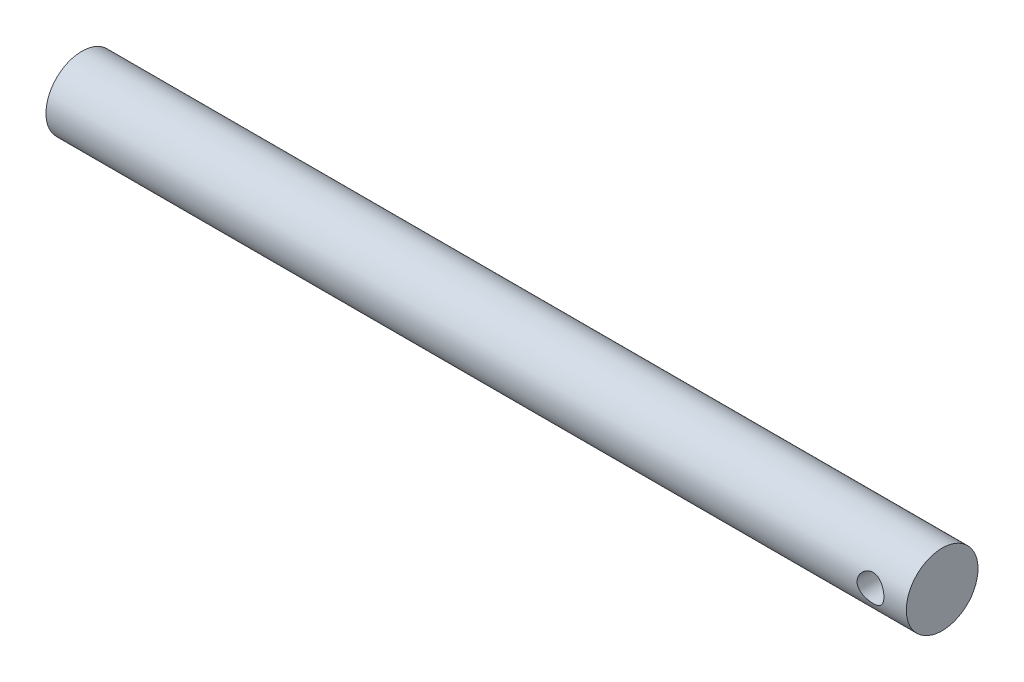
ISO-10303-21;
HEADER;
FILE_DESCRIPTION(('STEP AP214'),'2;1');
FILE_NAME('part.step','',(''),(''),'','','');
FILE_SCHEMA(('AUTOMOTIVE_DESIGN { 1 0 10303 214 1 1 1 1 }'));
ENDSEC;
DATA;
#1=APPLICATION_CONTEXT('core data for automotive mechanical design processes');
#2=APPLICATION_PROTOCOL_DEFINITION('international standard','automotive_design',2000,#1);
#3=PRODUCT_CONTEXT('',#1,'mechanical');
#4=PRODUCT('Part','Part','',(#3));
#5=PRODUCT_RELATED_PRODUCT_CATEGORY('part','',(#4));
#6=PRODUCT_DEFINITION_FORMATION('','',#4);
#7=PRODUCT_DEFINITION_CONTEXT('part definition',#1,'design');
#8=PRODUCT_DEFINITION('design','',#6,#7);
#9=PRODUCT_DEFINITION_SHAPE('','',#8);
#10=(LENGTH_UNIT() NAMED_UNIT(*) SI_UNIT(.MILLI.,.METRE.));
#11=(NAMED_UNIT(*) PLANE_ANGLE_UNIT() SI_UNIT($,.RADIAN.));
#12=(NAMED_UNIT(*) SI_UNIT($,.STERADIAN.) SOLID_ANGLE_UNIT());
#13=UNCERTAINTY_MEASURE_WITH_UNIT(LENGTH_MEASURE(1.E-05),#10,'distance_accuracy_value','');
#14=(GEOMETRIC_REPRESENTATION_CONTEXT(3) GLOBAL_UNCERTAINTY_ASSIGNED_CONTEXT((#13)) GLOBAL_UNIT_ASSIGNED_CONTEXT((#10,
#11,#12)) REPRESENTATION_CONTEXT('',''));
#15=CARTESIAN_POINT('',(0.,0.,0.));
#16=DIRECTION('',(0.,0.,1.));
#17=DIRECTION('',(1.,0.,0.));
#18=AXIS2_PLACEMENT_3D('',#15,#16,#17);
#19=CARTESIAN_POINT('',(152.4,0.,0.));
#20=DIRECTION('',(-1.,0.,0.));
#21=DIRECTION('',(0.,0.,1.));
#22=AXIS2_PLACEMENT_3D('',#19,#20,#21);
#23=CYLINDRICAL_SURFACE('',#22,6.35);
#24=CARTESIAN_POINT('',(148.43125,0.,-6.35));
#25=CARTESIAN_POINT('',(148.431254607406,0.128960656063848,-6.3500034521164));
#26=CARTESIAN_POINT('',(148.420741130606,0.257889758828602,-6.34603727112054));
#27=CARTESIAN_POINT('',(148.379135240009,0.51189485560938,-6.33061179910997));
#28=CARTESIAN_POINT('',(148.348045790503,0.636971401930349,-6.31915358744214));
#29=CARTESIAN_POINT('',(148.266542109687,0.879571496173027,-6.28997396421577));
#30=CARTESIAN_POINT('',(148.216165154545,0.997109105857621,-6.27226463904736));
#31=CARTESIAN_POINT('',(148.097706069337,1.22205640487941,-6.23234668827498));
#32=CARTESIAN_POINT('',(148.029619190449,1.32946336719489,-6.21013685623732));
#33=CARTESIAN_POINT('',(147.874652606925,1.53566243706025,-6.16245667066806));
#34=CARTESIAN_POINT('',(147.787153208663,1.63396728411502,-6.13689404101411));
#35=CARTESIAN_POINT('',(147.597160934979,1.81490019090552,-6.08584350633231));
#36=CARTESIAN_POINT('',(147.494663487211,1.89752345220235,-6.06035562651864));
#37=CARTESIAN_POINT('',(147.272823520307,2.04784646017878,-6.01126672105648));
#38=CARTESIAN_POINT('',(147.152988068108,2.11485786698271,-5.98777455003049));
#39=CARTESIAN_POINT('',(146.902728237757,2.22755851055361,-5.94677278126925));
#40=CARTESIAN_POINT('',(146.772308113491,2.27325626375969,-5.9292607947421));
#41=CARTESIAN_POINT('',(146.51018967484,2.34010884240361,-5.90318880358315));
#42=CARTESIAN_POINT('',(146.378763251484,2.36219354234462,-5.89429104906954));
#43=CARTESIAN_POINT('',(146.113791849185,2.38410045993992,-5.88546672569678));
#44=CARTESIAN_POINT('',(145.980247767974,2.38393187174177,-5.88553645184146));
#45=CARTESIAN_POINT('',(145.723340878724,2.36204807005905,-5.89434799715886));
#46=CARTESIAN_POINT('',(145.599847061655,2.34162296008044,-5.90257056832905));
#47=CARTESIAN_POINT('',(145.358187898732,2.28193866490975,-5.92589839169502));
#48=CARTESIAN_POINT('',(145.240023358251,2.24267664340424,-5.94100468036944));
#49=CARTESIAN_POINT('',(145.009747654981,2.14572450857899,-5.97671052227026));
#50=CARTESIAN_POINT('',(144.897793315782,2.08769979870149,-5.99740859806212));
#51=CARTESIAN_POINT('',(144.684836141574,1.95510267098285,-6.04193308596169));
#52=CARTESIAN_POINT('',(144.583837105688,1.88052453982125,-6.06576057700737));
#53=CARTESIAN_POINT('',(144.388516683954,1.71103576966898,-6.11581261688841));
#54=CARTESIAN_POINT('',(144.295100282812,1.61509549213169,-6.14209064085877));
#55=CARTESIAN_POINT('',(144.125413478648,1.40860873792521,-6.19270618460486));
#56=CARTESIAN_POINT('',(144.049145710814,1.29806002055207,-6.21704340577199));
#57=CARTESIAN_POINT('',(143.914922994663,1.06318595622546,-6.26151901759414));
#58=CARTESIAN_POINT('',(143.857269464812,0.938674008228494,-6.2815866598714));
#59=CARTESIAN_POINT('',(143.764027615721,0.680778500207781,-6.31473715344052));
#60=CARTESIAN_POINT('',(143.728429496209,0.547398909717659,-6.3278231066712));
#61=CARTESIAN_POINT('',(143.682048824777,0.283170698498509,-6.34499053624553));
#62=CARTESIAN_POINT('',(143.670047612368,0.152564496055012,-6.34951373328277));
#63=CARTESIAN_POINT('',(143.667652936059,-0.108858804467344,-6.3504110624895));
#64=CARTESIAN_POINT('',(143.677254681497,-0.239675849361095,-6.34678700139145));
#65=CARTESIAN_POINT('',(143.716867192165,-0.492541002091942,-6.33208839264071));
#66=CARTESIAN_POINT('',(143.746079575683,-0.614732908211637,-6.32130547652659));
#67=CARTESIAN_POINT('',(143.823032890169,-0.852395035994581,-6.29366719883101));
#68=CARTESIAN_POINT('',(143.870776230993,-0.967864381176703,-6.27681104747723));
#69=CARTESIAN_POINT('',(143.984958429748,-1.19260582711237,-6.23807528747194));
#70=CARTESIAN_POINT('',(144.051905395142,-1.301596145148,-6.2160626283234));
#71=CARTESIAN_POINT('',(144.202019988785,-1.50716092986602,-6.16944841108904));
#72=CARTESIAN_POINT('',(144.285193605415,-1.60373079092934,-6.14484589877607));
#73=CARTESIAN_POINT('',(144.471079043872,-1.78757389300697,-6.09398910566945));
#74=CARTESIAN_POINT('',(144.574644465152,-1.87398269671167,-6.06772180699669));
#75=CARTESIAN_POINT('',(144.795321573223,-2.02836541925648,-6.01787619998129));
#76=CARTESIAN_POINT('',(144.912434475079,-2.09633768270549,-5.99429813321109));
#77=CARTESIAN_POINT('',(145.157850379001,-2.21198715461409,-5.9525984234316));
#78=CARTESIAN_POINT('',(145.286197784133,-2.25957900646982,-5.93449982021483));
#79=CARTESIAN_POINT('',(145.549952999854,-2.33216265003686,-5.90635777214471));
#80=CARTESIAN_POINT('',(145.685356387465,-2.35716842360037,-5.89630934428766));
#81=CARTESIAN_POINT('',(145.950013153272,-2.3826207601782,-5.8860673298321));
#82=CARTESIAN_POINT('',(146.079103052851,-2.38454138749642,-5.88528230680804));
#83=CARTESIAN_POINT('',(146.335663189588,-2.36754536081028,-5.89213980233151));
#84=CARTESIAN_POINT('',(146.463133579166,-2.34863068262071,-5.89978152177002));
#85=CARTESIAN_POINT('',(146.708887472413,-2.29164857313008,-5.92213924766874));
#86=CARTESIAN_POINT('',(146.827332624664,-2.25418329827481,-5.93663223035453));
#87=CARTESIAN_POINT('',(147.056324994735,-2.16169393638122,-5.97092957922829));
#88=CARTESIAN_POINT('',(147.166870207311,-2.10666541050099,-5.99073528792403));
#89=CARTESIAN_POINT('',(147.383225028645,-1.97726420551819,-6.03471811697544));
#90=CARTESIAN_POINT('',(147.48848263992,-1.90202872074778,-6.0590699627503));
#91=CARTESIAN_POINT('',(147.685349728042,-1.73568496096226,-6.10879916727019));
#92=CARTESIAN_POINT('',(147.776954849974,-1.64457164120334,-6.13417684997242));
#93=CARTESIAN_POINT('',(147.948970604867,-1.44316512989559,-6.18474799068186));
#94=CARTESIAN_POINT('',(148.028507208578,-1.33210084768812,-6.20985716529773));
#95=CARTESIAN_POINT('',(148.167760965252,-1.09730099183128,-6.25561541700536));
#96=CARTESIAN_POINT('',(148.227476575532,-0.973564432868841,-6.27626414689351));
#97=CARTESIAN_POINT('',(148.327073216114,-0.71119854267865,-6.31149189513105));
#98=CARTESIAN_POINT('',(148.365983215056,-0.572156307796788,-6.3257693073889));
#99=CARTESIAN_POINT('',(148.418062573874,-0.288727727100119,-6.34501909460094));
#100=CARTESIAN_POINT('',(148.431244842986,-0.144344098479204,-6.34999613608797));
#101=CARTESIAN_POINT('',(148.43125,0.,-6.35));
#102=B_SPLINE_CURVE_WITH_KNOTS('',3,(#24,#25,#26,#27,#28,#29,#30,#31,#32,#33,#34,#35,#36,#37,
#38,#39,#40,#41,#42,#43,#44,#45,#46,#47,#48,#49,#50,#51,#52,#53,#54,#55,#56,#57,#58,#59,#60,#61,
#62,#63,#64,#65,#66,#67,#68,#69,#70,#71,#72,#73,#74,#75,#76,#77,#78,#79,#80,#81,#82,#83,#84,#85,
#86,#87,#88,#89,#90,#91,#92,#93,#94,#95,#96,#97,#98,#99,#100,#101),.UNSPECIFIED.,.T.,.F.,(4,2,2,
2,2,2,2,2,2,2,2,2,2,2,2,2,2,2,2,2,2,2,2,2,2,2,2,2,2,2,2,2,2,2,2,2,2,2,4),(0.,0.386349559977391,
0.772643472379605,1.15819454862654,1.54384911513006,1.94426869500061,2.34481060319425,
2.76060970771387,3.17624252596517,3.57482575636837,3.97324430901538,4.34781872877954,
4.72244956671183,5.10416823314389,5.48601885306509,5.89353268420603,6.30110909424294,
6.71498808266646,7.1286830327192,7.52038468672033,7.91199948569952,8.28856670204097,
8.66518290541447,9.05286514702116,9.44069073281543,9.85101724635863,10.2613805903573,
10.6734461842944,11.0852565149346,11.470620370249,11.8559476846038,12.2295148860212,
12.6031765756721,12.9964254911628,13.3897995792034,13.8044607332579,14.219154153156,
14.6518076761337,15.0842440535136),.UNSPECIFIED.);
#103=CARTESIAN_POINT('',(148.43125,0.,-6.35));
#104=VERTEX_POINT('',#103);
#105=EDGE_CURVE('E10',#104,#104,#102,.T.);
#106=ORIENTED_EDGE('',*,*,#105,.T.);
#107=EDGE_LOOP('',(#106));
#108=FACE_BOUND('',#107,.T.);
#109=CARTESIAN_POINT('',(148.43125,0.,6.35));
#110=CARTESIAN_POINT('',(148.431254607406,-0.128960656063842,6.3500034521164));
#111=CARTESIAN_POINT('',(148.420741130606,-0.257889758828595,6.34603727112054));
#112=CARTESIAN_POINT('',(148.379135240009,-0.511894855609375,6.33061179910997));
#113=CARTESIAN_POINT('',(148.348045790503,-0.636971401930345,6.31915358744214));
#114=CARTESIAN_POINT('',(148.266542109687,-0.879571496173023,6.28997396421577));
#115=CARTESIAN_POINT('',(148.216165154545,-0.997109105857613,6.27226463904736));
#116=CARTESIAN_POINT('',(148.097706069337,-1.2220564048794,6.23234668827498));
#117=CARTESIAN_POINT('',(148.029619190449,-1.32946336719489,6.21013685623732));
#118=CARTESIAN_POINT('',(147.874652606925,-1.53566243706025,6.16245667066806));
#119=CARTESIAN_POINT('',(147.787153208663,-1.63396728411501,6.13689404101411));
#120=CARTESIAN_POINT('',(147.597160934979,-1.81490019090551,6.08584350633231));
#121=CARTESIAN_POINT('',(147.494663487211,-1.89752345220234,6.06035562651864));
#122=CARTESIAN_POINT('',(147.272823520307,-2.04784646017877,6.01126672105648));
#123=CARTESIAN_POINT('',(147.152988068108,-2.1148578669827,5.98777455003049));
#124=CARTESIAN_POINT('',(146.902728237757,-2.2275585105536,5.94677278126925));
#125=CARTESIAN_POINT('',(146.772308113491,-2.27325626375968,5.92926079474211));
#126=CARTESIAN_POINT('',(146.51018967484,-2.3401088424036,5.90318880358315));
#127=CARTESIAN_POINT('',(146.378763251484,-2.36219354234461,5.89429104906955));
#128=CARTESIAN_POINT('',(146.113791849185,-2.38410045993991,5.88546672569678));
#129=CARTESIAN_POINT('',(145.980247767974,-2.38393187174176,5.88553645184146));
#130=CARTESIAN_POINT('',(145.723340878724,-2.36204807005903,5.89434799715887));
#131=CARTESIAN_POINT('',(145.599847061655,-2.34162296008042,5.90257056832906));
#132=CARTESIAN_POINT('',(145.358187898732,-2.28193866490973,5.92589839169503));
#133=CARTESIAN_POINT('',(145.24002335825,-2.24267664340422,5.94100468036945));
#134=CARTESIAN_POINT('',(145.009747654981,-2.14572450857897,5.97671052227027));
#135=CARTESIAN_POINT('',(144.897793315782,-2.08769979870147,5.99740859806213));
#136=CARTESIAN_POINT('',(144.684836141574,-1.95510267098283,6.04193308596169));
#137=CARTESIAN_POINT('',(144.583837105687,-1.88052453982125,6.06576057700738));
#138=CARTESIAN_POINT('',(144.388516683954,-1.71103576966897,6.11581261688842));
#139=CARTESIAN_POINT('',(144.295100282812,-1.61509549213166,6.14209064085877));
#140=CARTESIAN_POINT('',(144.125413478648,-1.40860873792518,6.19270618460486));
#141=CARTESIAN_POINT('',(144.049145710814,-1.29806002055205,6.21704340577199));
#142=CARTESIAN_POINT('',(143.914922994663,-1.06318595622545,6.26151901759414));
#143=CARTESIAN_POINT('',(143.857269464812,-0.938674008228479,6.2815866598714));
#144=CARTESIAN_POINT('',(143.764027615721,-0.680778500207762,6.31473715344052));
#145=CARTESIAN_POINT('',(143.728429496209,-0.54739890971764,6.32782310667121));
#146=CARTESIAN_POINT('',(143.682048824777,-0.28317069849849,6.34499053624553));
#147=CARTESIAN_POINT('',(143.670047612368,-0.152564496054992,6.34951373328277));
#148=CARTESIAN_POINT('',(143.667652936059,0.108858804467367,6.35041106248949));
#149=CARTESIAN_POINT('',(143.677254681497,0.23967584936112,6.34678700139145));
#150=CARTESIAN_POINT('',(143.716867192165,0.492541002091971,6.33208839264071));
#151=CARTESIAN_POINT('',(143.746079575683,0.614732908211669,6.32130547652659));
#152=CARTESIAN_POINT('',(143.823032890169,0.852395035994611,6.29366719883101));
#153=CARTESIAN_POINT('',(143.870776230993,0.96786438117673,6.27681104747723));
#154=CARTESIAN_POINT('',(143.984958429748,1.19260582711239,6.23807528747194));
#155=CARTESIAN_POINT('',(144.051905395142,1.30159614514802,6.2160626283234));
#156=CARTESIAN_POINT('',(144.202019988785,1.50716092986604,6.16944841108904));
#157=CARTESIAN_POINT('',(144.285193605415,1.60373079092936,6.14484589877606));
#158=CARTESIAN_POINT('',(144.471079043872,1.78757389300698,6.09398910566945));
#159=CARTESIAN_POINT('',(144.574644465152,1.87398269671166,6.0677218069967));
#160=CARTESIAN_POINT('',(144.795321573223,2.02836541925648,6.0178761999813));
#161=CARTESIAN_POINT('',(144.912434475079,2.09633768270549,5.99429813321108));
#162=CARTESIAN_POINT('',(145.157850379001,2.21198715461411,5.9525984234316));
#163=CARTESIAN_POINT('',(145.286197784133,2.25957900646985,5.93449982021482));
#164=CARTESIAN_POINT('',(145.549952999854,2.33216265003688,5.9063577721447));
#165=CARTESIAN_POINT('',(145.685356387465,2.35716842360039,5.89630934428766));
#166=CARTESIAN_POINT('',(145.950013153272,2.38262076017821,5.8860673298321));
#167=CARTESIAN_POINT('',(146.079103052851,2.38454138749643,5.88528230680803));
#168=CARTESIAN_POINT('',(146.335663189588,2.36754536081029,5.89213980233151));
#169=CARTESIAN_POINT('',(146.463133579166,2.34863068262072,5.89978152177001));
#170=CARTESIAN_POINT('',(146.708887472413,2.29164857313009,5.92213924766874));
#171=CARTESIAN_POINT('',(146.827332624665,2.25418329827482,5.93663223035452));
#172=CARTESIAN_POINT('',(147.056324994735,2.16169393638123,5.97092957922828));
#173=CARTESIAN_POINT('',(147.166870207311,2.106665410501,5.99073528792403));
#174=CARTESIAN_POINT('',(147.383225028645,1.9772642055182,6.03471811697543));
#175=CARTESIAN_POINT('',(147.48848263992,1.90202872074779,6.0590699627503));
#176=CARTESIAN_POINT('',(147.685349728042,1.73568496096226,6.10879916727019));
#177=CARTESIAN_POINT('',(147.776954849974,1.64457164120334,6.13417684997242));
#178=CARTESIAN_POINT('',(147.948970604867,1.44316512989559,6.18474799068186));
#179=CARTESIAN_POINT('',(148.028507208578,1.33210084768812,6.20985716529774));
#180=CARTESIAN_POINT('',(148.167760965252,1.09730099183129,6.25561541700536));
#181=CARTESIAN_POINT('',(148.227476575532,0.973564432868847,6.2762641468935));
#182=CARTESIAN_POINT('',(148.327073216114,0.711198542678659,6.31149189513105));
#183=CARTESIAN_POINT('',(148.365983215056,0.572156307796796,6.3257693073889));
#184=CARTESIAN_POINT('',(148.418062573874,0.288727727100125,6.34501909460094));
#185=CARTESIAN_POINT('',(148.431244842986,0.14434409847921,6.34999613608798));
#186=CARTESIAN_POINT('',(148.43125,0.,6.35));
#187=B_SPLINE_CURVE_WITH_KNOTS('',3,(#109,#110,#111,#112,#113,#114,#115,#116,#117,#118,#119,
#120,#121,#122,#123,#124,#125,#126,#127,#128,#129,#130,#131,#132,#133,#134,#135,#136,#137,#138,
#139,#140,#141,#142,#143,#144,#145,#146,#147,#148,#149,#150,#151,#152,#153,#154,#155,#156,#157,
#158,#159,#160,#161,#162,#163,#164,#165,#166,#167,#168,#169,#170,#171,#172,#173,#174,#175,#176,
#177,#178,#179,#180,#181,#182,#183,#184,#185,#186),.UNSPECIFIED.,.T.,.F.,(4,2,2,2,2,2,2,2,2,2,2,
2,2,2,2,2,2,2,2,2,2,2,2,2,2,2,2,2,2,2,2,2,2,2,2,2,2,2,4),(0.,0.386349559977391,
0.772643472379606,1.15819454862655,1.54384911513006,1.94426869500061,2.34481060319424,
2.76060970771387,3.17624252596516,3.57482575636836,3.9732443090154,4.34781872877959,
4.72244956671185,5.10416823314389,5.4860188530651,5.89353268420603,6.30110909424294,
6.71498808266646,7.1286830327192,7.52038468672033,7.91199948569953,8.28856670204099,
8.66518290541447,9.05286514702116,9.44069073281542,9.85101724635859,10.2613805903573,
10.6734461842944,11.0852565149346,11.470620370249,11.8559476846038,12.2295148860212,
12.6031765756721,12.9964254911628,13.3897995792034,13.8044607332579,14.219154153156,
14.6518076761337,15.0842440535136),.UNSPECIFIED.);
#188=CARTESIAN_POINT('',(148.43125,0.,6.35));
#189=VERTEX_POINT('',#188);
#190=EDGE_CURVE('E41',#189,#189,#187,.T.);
#191=ORIENTED_EDGE('',*,*,#190,.T.);
#192=EDGE_LOOP('',(#191));
#193=FACE_BOUND('',#192,.T.);
#194=CARTESIAN_POINT('',(152.4,0.,0.));
#195=DIRECTION('',(1.,0.,0.));
#196=DIRECTION('',(0.,0.,-1.));
#197=AXIS2_PLACEMENT_3D('',#194,#195,#196);
#198=CIRCLE('',#197,6.35);
#199=CARTESIAN_POINT('',(152.4,0.,-6.35));
#200=VERTEX_POINT('',#199);
#201=EDGE_CURVE('E45',#200,#200,#198,.T.);
#202=ORIENTED_EDGE('',*,*,#201,.F.);
#203=EDGE_LOOP('',(#202));
#204=FACE_BOUND('',#203,.T.);
#205=CARTESIAN_POINT('',(0.,0.,0.));
#206=DIRECTION('',(1.,0.,0.));
#207=DIRECTION('',(0.,0.,-1.));
#208=AXIS2_PLACEMENT_3D('',#205,#206,#207);
#209=CIRCLE('',#208,6.35);
#210=CARTESIAN_POINT('',(0.,0.,-6.35));
#211=VERTEX_POINT('',#210);
#212=EDGE_CURVE('E49',#211,#211,#209,.T.);
#213=ORIENTED_EDGE('',*,*,#212,.T.);
#214=EDGE_LOOP('',(#213));
#215=FACE_BOUND('',#214,.T.);
#216=ADVANCED_FACE('F31',(#108,#193,#204,#215),#23,.T.);
#217=CARTESIAN_POINT('',(152.4,0.,0.));
#218=DIRECTION('',(1.,0.,0.));
#219=DIRECTION('',(0.,0.,-1.));
#220=AXIS2_PLACEMENT_3D('',#217,#218,#219);
#221=PLANE('',#220);
#222=ORIENTED_EDGE('',*,*,#201,.T.);
#223=EDGE_LOOP('',(#222));
#224=FACE_BOUND('',#223,.T.);
#225=ADVANCED_FACE('F60',(#224),#221,.T.);
#226=CARTESIAN_POINT('',(0.,0.,0.));
#227=DIRECTION('',(1.,0.,0.));
#228=DIRECTION('',(0.,0.,-1.));
#229=AXIS2_PLACEMENT_3D('',#226,#227,#228);
#230=PLANE('',#229);
#231=ORIENTED_EDGE('',*,*,#212,.F.);
#232=EDGE_LOOP('',(#231));
#233=FACE_BOUND('',#232,.T.);
#234=ADVANCED_FACE('F58',(#233),#230,.F.);
#235=CARTESIAN_POINT('',(146.05,0.,-6.35));
#236=DIRECTION('',(0.,0.,1.));
#237=DIRECTION('',(1.,0.,0.));
#238=AXIS2_PLACEMENT_3D('',#235,#236,#237);
#239=CYLINDRICAL_SURFACE('',#238,2.38125000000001);
#240=ORIENTED_EDGE('',*,*,#190,.F.);
#241=EDGE_LOOP('',(#240));
#242=FACE_BOUND('',#241,.T.);
#243=ORIENTED_EDGE('',*,*,#105,.F.);
#244=EDGE_LOOP('',(#243));
#245=FACE_BOUND('',#244,.T.);
#246=ADVANCED_FACE('F54',(#242,#245),#239,.F.);
#247=CLOSED_SHELL('',(#216,#225,#234,#246));
#248=MANIFOLD_SOLID_BREP('B2',#247);
#249=ADVANCED_BREP_SHAPE_REPRESENTATION('',(#18,#248),#14);
#250=SHAPE_DEFINITION_REPRESENTATION(#9,#249);
ENDSEC;
END-ISO-10303-21;
